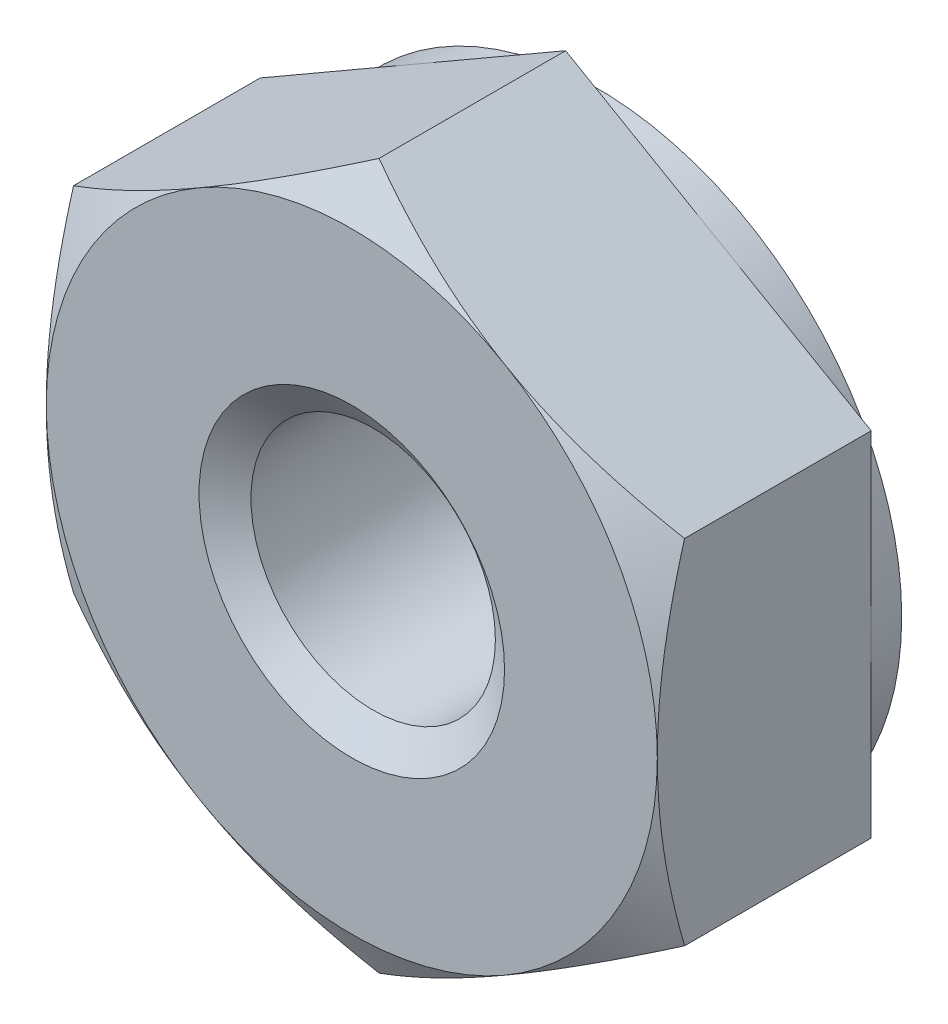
ISO-10303-21;
HEADER;
FILE_DESCRIPTION(('STEP AP214'),'2;1');
FILE_NAME('part.step','',(''),(''),'','','');
FILE_SCHEMA(('AUTOMOTIVE_DESIGN { 1 0 10303 214 1 1 1 1 }'));
ENDSEC;
DATA;
#1=APPLICATION_CONTEXT('core data for automotive mechanical design processes');
#2=APPLICATION_PROTOCOL_DEFINITION('international standard','automotive_design',2000,#1);
#3=PRODUCT_CONTEXT('',#1,'mechanical');
#4=PRODUCT('Part','Part','',(#3));
#5=PRODUCT_RELATED_PRODUCT_CATEGORY('part','',(#4));
#6=PRODUCT_DEFINITION_FORMATION('','',#4);
#7=PRODUCT_DEFINITION_CONTEXT('part definition',#1,'design');
#8=PRODUCT_DEFINITION('design','',#6,#7);
#9=PRODUCT_DEFINITION_SHAPE('','',#8);
#10=(LENGTH_UNIT() NAMED_UNIT(*) SI_UNIT(.MILLI.,.METRE.));
#11=(NAMED_UNIT(*) PLANE_ANGLE_UNIT() SI_UNIT($,.RADIAN.));
#12=(NAMED_UNIT(*) SI_UNIT($,.STERADIAN.) SOLID_ANGLE_UNIT());
#13=UNCERTAINTY_MEASURE_WITH_UNIT(LENGTH_MEASURE(1.E-05),#10,'distance_accuracy_value','');
#14=(GEOMETRIC_REPRESENTATION_CONTEXT(3) GLOBAL_UNCERTAINTY_ASSIGNED_CONTEXT((#13)) GLOBAL_UNIT_ASSIGNED_CONTEXT((#10,
#11,#12)) REPRESENTATION_CONTEXT('',''));
#15=CARTESIAN_POINT('',(0.,0.,0.));
#16=DIRECTION('',(0.,0.,1.));
#17=DIRECTION('',(1.,0.,0.));
#18=AXIS2_PLACEMENT_3D('',#15,#16,#17);
#19=CARTESIAN_POINT('',(0.,0.,-1.6));
#20=DIRECTION('',(0.,0.,1.));
#21=DIRECTION('',(1.,0.,0.));
#22=AXIS2_PLACEMENT_3D('',#19,#20,#21);
#23=CYLINDRICAL_SURFACE('',#22,0.8);
#24=CARTESIAN_POINT('',(0.,0.,-0.140041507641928));
#25=DIRECTION('',(0.,0.,1.));
#26=DIRECTION('',(1.,0.,0.));
#27=AXIS2_PLACEMENT_3D('',#24,#25,#26);
#28=CIRCLE('',#27,0.8);
#29=CARTESIAN_POINT('',(0.8,0.,-0.140041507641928));
#30=VERTEX_POINT('',#29);
#31=EDGE_CURVE('E148',#30,#30,#28,.F.);
#32=ORIENTED_EDGE('',*,*,#31,.F.);
#33=EDGE_LOOP('',(#32));
#34=FACE_BOUND('',#33,.T.);
#35=CARTESIAN_POINT('',(0.,0.,-1.43455849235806));
#36=DIRECTION('',(0.,0.,-1.));
#37=DIRECTION('',(-1.,0.,0.));
#38=AXIS2_PLACEMENT_3D('',#35,#36,#37);
#39=CIRCLE('',#38,0.8);
#40=CARTESIAN_POINT('',(-0.8,0.,-1.43455849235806));
#41=VERTEX_POINT('',#40);
#42=EDGE_CURVE('E36',#41,#41,#39,.F.);
#43=ORIENTED_EDGE('',*,*,#42,.F.);
#44=EDGE_LOOP('',(#43));
#45=FACE_BOUND('',#44,.T.);
#46=ADVANCED_FACE('F31',(#34,#45),#23,.F.);
#47=CARTESIAN_POINT('',(0.,2.30940107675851,-1.6));
#48=DIRECTION('',(0.,0.,-1.));
#49=DIRECTION('',(-1.,0.,0.));
#50=AXIS2_PLACEMENT_3D('',#47,#48,#49);
#51=PLANE('',#50);
#52=CARTESIAN_POINT('',(0.,0.,-1.6));
#53=DIRECTION('',(0.,0.,-1.));
#54=DIRECTION('',(-1.,0.,0.));
#55=AXIS2_PLACEMENT_3D('',#52,#53,#54);
#56=CIRCLE('',#55,2.);
#57=CARTESIAN_POINT('',(-2.,0.,-1.6));
#58=VERTEX_POINT('',#57);
#59=EDGE_CURVE('E275',#58,#58,#56,.F.);
#60=ORIENTED_EDGE('',*,*,#59,.F.);
#61=EDGE_LOOP('',(#60));
#62=FACE_BOUND('',#61,.T.);
#63=CARTESIAN_POINT('',(0.,0.,-1.6));
#64=DIRECTION('',(0.,0.,-1.));
#65=DIRECTION('',(-1.,0.,0.));
#66=AXIS2_PLACEMENT_3D('',#63,#64,#65);
#67=CIRCLE('',#66,1.);
#68=CARTESIAN_POINT('',(-1.,0.,-1.6));
#69=VERTEX_POINT('',#68);
#70=EDGE_CURVE('E295',#69,#69,#67,.F.);
#71=ORIENTED_EDGE('',*,*,#70,.T.);
#72=EDGE_LOOP('',(#71));
#73=FACE_BOUND('',#72,.T.);
#74=ADVANCED_FACE('F227',(#62,#73),#51,.T.);
#75=CARTESIAN_POINT('',(0.,2.30940107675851,0.));
#76=DIRECTION('',(0.,0.,-1.));
#77=DIRECTION('',(-1.,0.,0.));
#78=AXIS2_PLACEMENT_3D('',#75,#76,#77);
#79=PLANE('',#78);
#80=CARTESIAN_POINT('',(0.,0.,0.));
#81=DIRECTION('',(0.,0.,-1.));
#82=DIRECTION('',(-1.,0.,0.));
#83=AXIS2_PLACEMENT_3D('',#80,#81,#82);
#84=CIRCLE('',#83,2.);
#85=CARTESIAN_POINT('',(-1.00000000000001,1.73205080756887,0.));
#86=VERTEX_POINT('',#85);
#87=CARTESIAN_POINT('',(-2.,0.,0.));
#88=VERTEX_POINT('',#87);
#89=EDGE_CURVE('E43',#86,#88,#84,.F.);
#90=ORIENTED_EDGE('',*,*,#89,.T.);
#91=CARTESIAN_POINT('',(-1.00000000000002,-1.73205080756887,0.));
#92=VERTEX_POINT('',#91);
#93=EDGE_CURVE('E12',#88,#92,#84,.F.);
#94=ORIENTED_EDGE('',*,*,#93,.T.);
#95=CARTESIAN_POINT('',(1.00000000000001,-1.73205080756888,0.));
#96=VERTEX_POINT('',#95);
#97=EDGE_CURVE('E41',#92,#96,#84,.F.);
#98=ORIENTED_EDGE('',*,*,#97,.T.);
#99=CARTESIAN_POINT('',(2.,0.,0.));
#100=VERTEX_POINT('',#99);
#101=EDGE_CURVE('E127',#96,#100,#84,.F.);
#102=ORIENTED_EDGE('',*,*,#101,.T.);
#103=CARTESIAN_POINT('',(0.,0.,0.));
#104=DIRECTION('',(0.,0.,1.));
#105=DIRECTION('',(1.,0.,0.));
#106=AXIS2_PLACEMENT_3D('',#103,#104,#105);
#107=CIRCLE('',#106,2.);
#108=CARTESIAN_POINT('',(1.00000000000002,1.73205080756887,0.));
#109=VERTEX_POINT('',#108);
#110=EDGE_CURVE('E139',#100,#109,#107,.T.);
#111=ORIENTED_EDGE('',*,*,#110,.T.);
#112=EDGE_CURVE('E154',#109,#86,#84,.F.);
#113=ORIENTED_EDGE('',*,*,#112,.T.);
#114=EDGE_LOOP('',(#90,#94,#98,#102,#111,#113));
#115=FACE_BOUND('',#114,.T.);
#116=CARTESIAN_POINT('',(0.,0.,0.));
#117=DIRECTION('',(0.,0.,1.));
#118=DIRECTION('',(1.,0.,0.));
#119=AXIS2_PLACEMENT_3D('',#116,#117,#118);
#120=CIRCLE('',#119,1.);
#121=CARTESIAN_POINT('',(1.,0.,0.));
#122=VERTEX_POINT('',#121);
#123=EDGE_CURVE('E294',#122,#122,#120,.T.);
#124=ORIENTED_EDGE('',*,*,#123,.F.);
#125=EDGE_LOOP('',(#124));
#126=FACE_BOUND('',#125,.T.);
#127=ADVANCED_FACE('F151',(#115,#126),#79,.F.);
#128=CARTESIAN_POINT('',(0.,2.30940107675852,-1.6));
#129=DIRECTION('',(-0.500000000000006,0.866025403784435,0.));
#130=DIRECTION('',(-0.866025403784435,-0.500000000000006,0.));
#131=AXIS2_PLACEMENT_3D('',#128,#129,#130);
#132=PLANE('',#131);
#133=DIRECTION('',(0.,0.,1.));
#134=VECTOR('',#133,1.);
#135=CARTESIAN_POINT('',(-2.,1.15470053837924,-1.6));
#136=LINE('',#135,#134);
#137=CARTESIAN_POINT('',(-2.,1.15470053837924,-1.40000000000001));
#138=VERTEX_POINT('',#137);
#139=CARTESIAN_POINT('',(-2.,1.15470053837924,-0.178632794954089));
#140=VERTEX_POINT('',#139);
#141=EDGE_CURVE('E284',#138,#140,#136,.T.);
#142=ORIENTED_EDGE('',*,*,#141,.T.);
#143=CARTESIAN_POINT('',(-2.0002,1.1545850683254,-0.178699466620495));
#144=CARTESIAN_POINT('',(-1.91230873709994,1.20532911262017,-0.149389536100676));
#145=CARTESIAN_POINT('',(-1.82365880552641,1.25651117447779,-0.122732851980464));
#146=CARTESIAN_POINT('',(-1.6448237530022,1.35976164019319,-0.0762024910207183));
#147=CARTESIAN_POINT('',(-1.55463545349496,1.41183187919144,-0.0563452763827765));
#148=CARTESIAN_POINT('',(-1.3753766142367,1.51532701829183,-0.0254334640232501));
#149=CARTESIAN_POINT('',(-1.2863336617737,1.56673599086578,-0.0141731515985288));
#150=CARTESIAN_POINT('',(-1.10782860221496,1.66979593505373,-0.000728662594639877));
#151=CARTESIAN_POINT('',(-1.01836714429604,1.72144653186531,0.00146664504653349));
#152=CARTESIAN_POINT('',(-0.851191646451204,1.81796535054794,-0.00309098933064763));
#153=CARTESIAN_POINT('',(-0.773452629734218,1.86284799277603,-0.00872487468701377));
#154=CARTESIAN_POINT('',(-0.618481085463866,1.95232085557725,-0.0265838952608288));
#155=CARTESIAN_POINT('',(-0.5412490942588,1.99691076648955,-0.0388151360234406));
#156=CARTESIAN_POINT('',(-0.385957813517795,2.08656822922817,-0.0693934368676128));
#157=CARTESIAN_POINT('',(-0.307918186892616,2.13162442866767,-0.0878701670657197));
#158=CARTESIAN_POINT('',(-0.153003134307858,2.22106467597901,-0.129805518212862));
#159=CARTESIAN_POINT('',(-0.0761257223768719,2.26544987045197,-0.15325428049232));
#160=CARTESIAN_POINT('',(0.000200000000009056,2.30951654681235,-0.178699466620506));
#161=B_SPLINE_CURVE_WITH_KNOTS('',3,(#143,#144,#145,#146,#147,#148,#149,#150,#151,#152,#153,
#154,#155,#156,#157,#158,#159,#160),.UNSPECIFIED.,.F.,.F.,(4,2,2,2,2,2,2,2,4),(0.,
0.31703182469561,0.634825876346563,0.944753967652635,1.25430138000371,1.52387047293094,
1.79368946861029,2.06949491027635,2.34475850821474),.UNSPECIFIED.);
#162=EDGE_CURVE('E55',#140,#86,#161,.T.);
#163=ORIENTED_EDGE('',*,*,#162,.T.);
#164=CARTESIAN_POINT('',(0.,2.30940107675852,-0.178632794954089));
#165=VERTEX_POINT('',#164);
#166=EDGE_CURVE('E163',#86,#165,#161,.T.);
#167=ORIENTED_EDGE('',*,*,#166,.T.);
#168=DIRECTION('',(0.,0.,1.));
#169=VECTOR('',#168,1.);
#170=CARTESIAN_POINT('',(0.,2.30940107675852,-1.6));
#171=LINE('',#170,#169);
#172=CARTESIAN_POINT('',(0.,2.30940107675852,-1.40000000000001));
#173=VERTEX_POINT('',#172);
#174=EDGE_CURVE('E272',#173,#165,#171,.T.);
#175=ORIENTED_EDGE('',*,*,#174,.F.);
#176=DIRECTION('',(-0.866025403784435,-0.500000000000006,0.));
#177=VECTOR('',#176,1.);
#178=CARTESIAN_POINT('',(0.,2.30940107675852,-1.40000000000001));
#179=LINE('',#178,#177);
#180=CARTESIAN_POINT('',(-1.00000000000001,1.73205080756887,-1.40000000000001));
#181=VERTEX_POINT('',#180);
#182=EDGE_CURVE('E260',#173,#181,#179,.T.);
#183=ORIENTED_EDGE('',*,*,#182,.T.);
#184=EDGE_CURVE('E256',#181,#138,#179,.T.);
#185=ORIENTED_EDGE('',*,*,#184,.T.);
#186=EDGE_LOOP('',(#142,#163,#167,#175,#183,#185));
#187=FACE_BOUND('',#186,.T.);
#188=ADVANCED_FACE('F33',(#187),#132,.T.);
#189=CARTESIAN_POINT('',(2.00000000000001,1.15470053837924,-1.6));
#190=DIRECTION('',(0.500000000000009,0.866025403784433,0.));
#191=DIRECTION('',(-0.866025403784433,0.500000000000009,0.));
#192=AXIS2_PLACEMENT_3D('',#189,#190,#191);
#193=PLANE('',#192);
#194=ORIENTED_EDGE('',*,*,#174,.T.);
#195=CARTESIAN_POINT('',(-0.000199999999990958,2.30951654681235,-0.178699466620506));
#196=CARTESIAN_POINT('',(0.0876912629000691,2.25877250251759,-0.149389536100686));
#197=CARTESIAN_POINT('',(0.1763411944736,2.20759044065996,-0.122732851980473));
#198=CARTESIAN_POINT('',(0.355176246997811,2.10433997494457,-0.0762024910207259));
#199=CARTESIAN_POINT('',(0.445364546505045,2.05226973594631,-0.0563452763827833));
#200=CARTESIAN_POINT('',(0.624623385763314,1.94877459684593,-0.0254334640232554));
#201=CARTESIAN_POINT('',(0.713666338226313,1.89736562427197,-0.0141731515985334));
#202=CARTESIAN_POINT('',(0.892171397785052,1.79430568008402,-0.00072866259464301));
#203=CARTESIAN_POINT('',(0.981632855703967,1.74265508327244,0.00146664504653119));
#204=CARTESIAN_POINT('',(1.14880835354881,1.64613626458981,-0.00309098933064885));
#205=CARTESIAN_POINT('',(1.22654737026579,1.60125362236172,-0.00872487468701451));
#206=CARTESIAN_POINT('',(1.38151891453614,1.5117807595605,-0.026583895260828));
#207=CARTESIAN_POINT('',(1.45875090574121,1.4671908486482,-0.0388151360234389));
#208=CARTESIAN_POINT('',(1.61404218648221,1.37753338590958,-0.0693934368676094));
#209=CARTESIAN_POINT('',(1.69208181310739,1.33247718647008,-0.0878701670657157));
#210=CARTESIAN_POINT('',(1.84699686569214,1.24303693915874,-0.129805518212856));
#211=CARTESIAN_POINT('',(1.92387427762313,1.19865174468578,-0.153254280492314));
#212=CARTESIAN_POINT('',(2.00020000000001,1.1545850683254,-0.178699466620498));
#213=B_SPLINE_CURVE_WITH_KNOTS('',3,(#195,#196,#197,#198,#199,#200,#201,#202,#203,#204,#205,
#206,#207,#208,#209,#210,#211,#212),.UNSPECIFIED.,.F.,.F.,(4,2,2,2,2,2,2,2,4),(0.,
0.317031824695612,0.634825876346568,0.944753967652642,1.25430138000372,1.52387047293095,
1.79368946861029,2.06949491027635,2.34475850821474),.UNSPECIFIED.);
#214=EDGE_CURVE('E160',#165,#109,#213,.T.);
#215=ORIENTED_EDGE('',*,*,#214,.T.);
#216=CARTESIAN_POINT('',(2.00000000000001,1.15470053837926,-0.178632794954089));
#217=VERTEX_POINT('',#216);
#218=EDGE_CURVE('E142',#109,#217,#213,.T.);
#219=ORIENTED_EDGE('',*,*,#218,.T.);
#220=DIRECTION('',(0.,0.,1.));
#221=VECTOR('',#220,1.);
#222=CARTESIAN_POINT('',(2.00000000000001,1.15470053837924,-1.6));
#223=LINE('',#222,#221);
#224=CARTESIAN_POINT('',(2.00000000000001,1.15470053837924,-1.40000000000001));
#225=VERTEX_POINT('',#224);
#226=EDGE_CURVE('E159',#225,#217,#223,.T.);
#227=ORIENTED_EDGE('',*,*,#226,.F.);
#228=DIRECTION('',(-0.866025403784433,0.500000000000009,0.));
#229=VECTOR('',#228,1.);
#230=CARTESIAN_POINT('',(2.00000000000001,1.15470053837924,-1.40000000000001));
#231=LINE('',#230,#229);
#232=CARTESIAN_POINT('',(1.00000000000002,1.73205080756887,-1.40000000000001));
#233=VERTEX_POINT('',#232);
#234=EDGE_CURVE('E268',#225,#233,#231,.T.);
#235=ORIENTED_EDGE('',*,*,#234,.T.);
#236=EDGE_CURVE('E264',#233,#173,#231,.T.);
#237=ORIENTED_EDGE('',*,*,#236,.T.);
#238=EDGE_LOOP('',(#194,#215,#219,#227,#235,#237));
#239=FACE_BOUND('',#238,.T.);
#240=ADVANCED_FACE('F240',(#239),#193,.T.);
#241=CARTESIAN_POINT('',(2.00000000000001,1.15470053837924,-1.6));
#242=DIRECTION('',(-1.,0.,0.));
#243=DIRECTION('',(0.,0.,1.));
#244=AXIS2_PLACEMENT_3D('',#241,#242,#243);
#245=PLANE('',#244);
#246=CARTESIAN_POINT('',(2.00000000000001,-3.0624359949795,-0.957053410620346));
#247=CARTESIAN_POINT('',(2.00000000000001,-2.97462468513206,-0.914618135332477));
#248=CARTESIAN_POINT('',(2.00000000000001,-2.88660576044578,-0.872604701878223));
#249=CARTESIAN_POINT('',(2.00000000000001,-2.7100404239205,-0.789662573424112));
#250=CARTESIAN_POINT('',(2.00000000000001,-2.62149392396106,-0.748734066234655));
#251=CARTESIAN_POINT('',(2.00000000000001,-2.44328285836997,-0.667987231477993));
#252=CARTESIAN_POINT('',(2.00000000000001,-2.35361479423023,-0.628176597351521));
#253=CARTESIAN_POINT('',(2.00000000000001,-2.17354167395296,-0.55026529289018));
#254=CARTESIAN_POINT('',(2.00000000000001,-2.08313665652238,-0.51216453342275));
#255=CARTESIAN_POINT('',(2.00000000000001,-1.90031404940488,-0.437671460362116));
#256=CARTESIAN_POINT('',(2.00000000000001,-1.80788540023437,-0.401306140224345));
#257=CARTESIAN_POINT('',(2.00000000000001,-1.62195694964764,-0.33143120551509));
#258=CARTESIAN_POINT('',(2.00000000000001,-1.52845725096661,-0.297921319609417));
#259=CARTESIAN_POINT('',(2.00000000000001,-1.34040158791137,-0.234645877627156));
#260=CARTESIAN_POINT('',(2.00000000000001,-1.24584820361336,-0.204872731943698));
#261=CARTESIAN_POINT('',(2.00000000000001,-1.05539728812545,-0.150041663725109));
#262=CARTESIAN_POINT('',(2.00000000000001,-0.959500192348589,-0.124982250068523));
#263=CARTESIAN_POINT('',(2.00000000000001,-0.766296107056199,-0.0807954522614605));
#264=CARTESIAN_POINT('',(2.00000000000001,-0.668988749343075,-0.0616696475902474));
#265=CARTESIAN_POINT('',(2.00000000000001,-0.473201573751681,-0.0306369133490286));
#266=CARTESIAN_POINT('',(2.00000000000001,-0.374721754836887,-0.0187299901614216));
#267=CARTESIAN_POINT('',(2.00000000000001,-0.177725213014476,-0.00319166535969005));
#268=CARTESIAN_POINT('',(2.00000000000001,-0.0792127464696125,0.000492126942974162));
#269=CARTESIAN_POINT('',(2.00000000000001,0.117733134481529,-0.000599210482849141));
#270=CARTESIAN_POINT('',(2.00000000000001,0.216166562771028,-0.00537214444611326));
#271=CARTESIAN_POINT('',(2.00000000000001,0.454297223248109,-0.0267243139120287));
#272=CARTESIAN_POINT('',(2.00000000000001,0.593620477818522,-0.0474829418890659));
#273=CARTESIAN_POINT('',(2.00000000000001,0.869689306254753,-0.102199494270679));
#274=CARTESIAN_POINT('',(2.00000000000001,1.0064316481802,-0.136172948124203));
#275=CARTESIAN_POINT('',(2.00000000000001,1.21108706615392,-0.194758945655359));
#276=CARTESIAN_POINT('',(2.00000000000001,1.28004655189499,-0.215857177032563));
#277=CARTESIAN_POINT('',(2.00000000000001,1.41724192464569,-0.260142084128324));
#278=CARTESIAN_POINT('',(2.00000000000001,1.48547827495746,-0.283327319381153));
#279=CARTESIAN_POINT('',(2.00000000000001,1.62094688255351,-0.331302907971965));
#280=CARTESIAN_POINT('',(2.00000000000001,1.68818262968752,-0.356083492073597));
#281=CARTESIAN_POINT('',(2.00000000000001,1.82213246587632,-0.40709914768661));
#282=CARTESIAN_POINT('',(2.00000000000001,1.88884633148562,-0.433334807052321));
#283=CARTESIAN_POINT('',(2.00000000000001,1.95531849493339,-0.46015450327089));
#284=B_SPLINE_CURVE_WITH_KNOTS('',3,(#246,#247,#248,#249,#250,#251,#252,#253,#254,#255,#256,
#257,#258,#259,#260,#261,#262,#263,#264,#265,#266,#267,#268,#269,#270,#271,#272,#273,#274,#275,
#276,#277,#278,#279,#280,#281,#282,#283),.UNSPECIFIED.,.F.,.F.,(4,2,2,2,2,2,2,2,2,2,2,2,2,2,2,2,
2,2,4),(0.,0.292585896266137,0.585222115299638,0.879532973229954,1.17382847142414,
1.47176772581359,1.76967863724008,2.06697432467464,2.364175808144,2.66145633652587,
2.95873712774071,3.25411843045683,3.54942304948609,3.97114178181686,4.39335760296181,
4.60967655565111,4.82584733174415,5.04080135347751,5.255842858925),.UNSPECIFIED.);
#285=CARTESIAN_POINT('',(1.99999999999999,-1.15470053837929,-0.178632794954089));
#286=VERTEX_POINT('',#285);
#287=EDGE_CURVE('E123',#286,#100,#284,.T.);
#288=ORIENTED_EDGE('',*,*,#287,.F.);
#289=DIRECTION('',(0.,0.,1.));
#290=VECTOR('',#289,1.);
#291=CARTESIAN_POINT('',(2.00000000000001,-1.15470053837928,-1.6));
#292=LINE('',#291,#290);
#293=CARTESIAN_POINT('',(2.00000000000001,-1.15470053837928,-1.40000000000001));
#294=VERTEX_POINT('',#293);
#295=EDGE_CURVE('E277',#294,#286,#292,.T.);
#296=ORIENTED_EDGE('',*,*,#295,.F.);
#297=DIRECTION('',(0.,-1.,0.));
#298=VECTOR('',#297,1.);
#299=CARTESIAN_POINT('',(2.00000000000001,1.15470053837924,-1.40000000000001));
#300=LINE('',#299,#298);
#301=CARTESIAN_POINT('',(2.00000000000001,0.,-1.40000000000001));
#302=VERTEX_POINT('',#301);
#303=EDGE_CURVE('E269',#302,#294,#300,.T.);
#304=ORIENTED_EDGE('',*,*,#303,.F.);
#305=EDGE_CURVE('E271',#225,#302,#300,.T.);
#306=ORIENTED_EDGE('',*,*,#305,.F.);
#307=ORIENTED_EDGE('',*,*,#226,.T.);
#308=EDGE_CURVE('E136',#100,#217,#284,.T.);
#309=ORIENTED_EDGE('',*,*,#308,.F.);
#310=EDGE_LOOP('',(#288,#296,#304,#306,#307,#309));
#311=FACE_BOUND('',#310,.T.);
#312=ADVANCED_FACE('F156',(#311),#245,.F.);
#313=CARTESIAN_POINT('',(0.,-2.30940107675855,-1.6));
#314=DIRECTION('',(0.500000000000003,-0.866025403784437,0.));
#315=DIRECTION('',(0.866025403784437,0.500000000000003,0.));
#316=AXIS2_PLACEMENT_3D('',#313,#314,#315);
#317=PLANE('',#316);
#318=ORIENTED_EDGE('',*,*,#295,.T.);
#319=CARTESIAN_POINT('',(2.00020000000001,-1.15458506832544,-0.178699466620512));
#320=CARTESIAN_POINT('',(1.91230873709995,-1.20532911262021,-0.149389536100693));
#321=CARTESIAN_POINT('',(1.82365880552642,-1.25651117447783,-0.122732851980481));
#322=CARTESIAN_POINT('',(1.6448237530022,-1.35976164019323,-0.0762024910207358));
#323=CARTESIAN_POINT('',(1.55463545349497,-1.41183187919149,-0.0563452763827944));
#324=CARTESIAN_POINT('',(1.3753766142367,-1.51532701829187,-0.0254334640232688));
#325=CARTESIAN_POINT('',(1.2863336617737,-1.56673599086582,-0.0141731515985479));
#326=CARTESIAN_POINT('',(1.10782860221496,-1.66979593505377,-0.000728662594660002));
#327=CARTESIAN_POINT('',(1.01836714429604,-1.72144653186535,0.00146664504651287));
#328=CARTESIAN_POINT('',(0.8511916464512,-1.81796535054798,-0.00309098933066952));
#329=CARTESIAN_POINT('',(0.773452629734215,-1.86284799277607,-0.00872487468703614));
#330=CARTESIAN_POINT('',(0.618481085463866,-1.95232085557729,-0.0265838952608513));
#331=CARTESIAN_POINT('',(0.541249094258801,-1.99691076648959,-0.0388151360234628));
#332=CARTESIAN_POINT('',(0.385957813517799,-2.08656822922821,-0.0693934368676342));
#333=CARTESIAN_POINT('',(0.307918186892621,-2.13162442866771,-0.0878701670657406));
#334=CARTESIAN_POINT('',(0.153003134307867,-2.22106467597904,-0.129805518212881));
#335=CARTESIAN_POINT('',(0.076125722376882,-2.265449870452,-0.153254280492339));
#336=CARTESIAN_POINT('',(-0.000199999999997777,-2.30951654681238,-0.178699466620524));
#337=B_SPLINE_CURVE_WITH_KNOTS('',3,(#319,#320,#321,#322,#323,#324,#325,#326,#327,#328,#329,
#330,#331,#332,#333,#334,#335,#336),.UNSPECIFIED.,.F.,.F.,(4,2,2,2,2,2,2,2,4),(0.,
0.317031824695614,0.634825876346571,0.944753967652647,1.25430138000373,1.52387047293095,
1.7936894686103,2.06949491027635,2.34475850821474),.UNSPECIFIED.);
#338=EDGE_CURVE('E130',#286,#96,#337,.T.);
#339=ORIENTED_EDGE('',*,*,#338,.T.);
#340=CARTESIAN_POINT('',(0.,-2.30940107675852,-0.178632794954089));
#341=VERTEX_POINT('',#340);
#342=EDGE_CURVE('E170',#96,#341,#337,.T.);
#343=ORIENTED_EDGE('',*,*,#342,.T.);
#344=DIRECTION('',(0.,0.,1.));
#345=VECTOR('',#344,1.);
#346=CARTESIAN_POINT('',(0.,-2.30940107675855,-1.6));
#347=LINE('',#346,#345);
#348=CARTESIAN_POINT('',(0.,-2.30940107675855,-1.40000000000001));
#349=VERTEX_POINT('',#348);
#350=EDGE_CURVE('E279',#349,#341,#347,.T.);
#351=ORIENTED_EDGE('',*,*,#350,.F.);
#352=DIRECTION('',(0.866025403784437,0.500000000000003,0.));
#353=VECTOR('',#352,1.);
#354=CARTESIAN_POINT('',(0.,-2.30940107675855,-1.40000000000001));
#355=LINE('',#354,#353);
#356=CARTESIAN_POINT('',(1.00000000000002,-1.7320508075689,-1.40000000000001));
#357=VERTEX_POINT('',#356);
#358=EDGE_CURVE('E261',#349,#357,#355,.T.);
#359=ORIENTED_EDGE('',*,*,#358,.T.);
#360=EDGE_CURVE('E265',#357,#294,#355,.T.);
#361=ORIENTED_EDGE('',*,*,#360,.T.);
#362=EDGE_LOOP('',(#318,#339,#343,#351,#359,#361));
#363=FACE_BOUND('',#362,.T.);
#364=ADVANCED_FACE('F213',(#363),#317,.T.);
#365=CARTESIAN_POINT('',(-2.,-1.15470053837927,-1.6));
#366=DIRECTION('',(-0.500000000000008,-0.866025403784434,0.));
#367=DIRECTION('',(0.866025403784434,-0.500000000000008,0.));
#368=AXIS2_PLACEMENT_3D('',#365,#366,#367);
#369=PLANE('',#368);
#370=ORIENTED_EDGE('',*,*,#350,.T.);
#371=CARTESIAN_POINT('',(0.000200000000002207,-2.30951654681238,-0.178699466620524));
#372=CARTESIAN_POINT('',(-0.0876912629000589,-2.25877250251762,-0.149389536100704));
#373=CARTESIAN_POINT('',(-0.176341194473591,-2.20759044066,-0.12273285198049));
#374=CARTESIAN_POINT('',(-0.355176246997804,-2.1043399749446,-0.0762024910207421));
#375=CARTESIAN_POINT('',(-0.44536454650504,-2.05226973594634,-0.0563452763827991));
#376=CARTESIAN_POINT('',(-0.624623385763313,-1.94877459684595,-0.0254334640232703));
#377=CARTESIAN_POINT('',(-0.713666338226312,-1.897365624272,-0.0141731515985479));
#378=CARTESIAN_POINT('',(-0.892171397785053,-1.79430568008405,-0.000728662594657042));
#379=CARTESIAN_POINT('',(-0.98163285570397,-1.74265508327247,0.00146664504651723));
#380=CARTESIAN_POINT('',(-1.14880835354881,-1.64613626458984,-0.00309098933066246));
#381=CARTESIAN_POINT('',(-1.22654737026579,-1.60125362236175,-0.00872487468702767));
#382=CARTESIAN_POINT('',(-1.38151891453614,-1.51178075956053,-0.0265838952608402));
#383=CARTESIAN_POINT('',(-1.45875090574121,-1.46719084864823,-0.0388151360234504));
#384=CARTESIAN_POINT('',(-1.61404218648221,-1.37753338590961,-0.0693934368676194));
#385=CARTESIAN_POINT('',(-1.69208181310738,-1.33247718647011,-0.0878701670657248));
#386=CARTESIAN_POINT('',(-1.84699686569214,-1.24303693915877,-0.129805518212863));
#387=CARTESIAN_POINT('',(-1.92387427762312,-1.19865174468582,-0.15325428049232));
#388=CARTESIAN_POINT('',(-2.0002,-1.15458506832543,-0.178699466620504));
#389=B_SPLINE_CURVE_WITH_KNOTS('',3,(#371,#372,#373,#374,#375,#376,#377,#378,#379,#380,#381,
#382,#383,#384,#385,#386,#387,#388),.UNSPECIFIED.,.F.,.F.,(4,2,2,2,2,2,2,2,4),(0.,
0.317031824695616,0.634825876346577,0.944753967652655,1.25430138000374,1.52387047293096,
1.7936894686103,2.06949491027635,2.34475850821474),.UNSPECIFIED.);
#390=EDGE_CURVE('E207',#341,#92,#389,.T.);
#391=ORIENTED_EDGE('',*,*,#390,.T.);
#392=CARTESIAN_POINT('',(-2.,-1.15470053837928,-0.178632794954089));
#393=VERTEX_POINT('',#392);
#394=EDGE_CURVE('E200',#92,#393,#389,.T.);
#395=ORIENTED_EDGE('',*,*,#394,.T.);
#396=DIRECTION('',(0.,0.,1.));
#397=VECTOR('',#396,1.);
#398=CARTESIAN_POINT('',(-2.,-1.15470053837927,-1.6));
#399=LINE('',#398,#397);
#400=CARTESIAN_POINT('',(-2.,-1.15470053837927,-1.40000000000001));
#401=VERTEX_POINT('',#400);
#402=EDGE_CURVE('E282',#401,#393,#399,.T.);
#403=ORIENTED_EDGE('',*,*,#402,.F.);
#404=DIRECTION('',(0.866025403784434,-0.500000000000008,0.));
#405=VECTOR('',#404,1.);
#406=CARTESIAN_POINT('',(-2.,-1.15470053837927,-1.40000000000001));
#407=LINE('',#406,#405);
#408=CARTESIAN_POINT('',(-1.00000000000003,-1.73205080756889,-1.40000000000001));
#409=VERTEX_POINT('',#408);
#410=EDGE_CURVE('E251',#401,#409,#407,.T.);
#411=ORIENTED_EDGE('',*,*,#410,.T.);
#412=EDGE_CURVE('E257',#409,#349,#407,.T.);
#413=ORIENTED_EDGE('',*,*,#412,.T.);
#414=EDGE_LOOP('',(#370,#391,#395,#403,#411,#413));
#415=FACE_BOUND('',#414,.T.);
#416=ADVANCED_FACE('F209',(#415),#369,.T.);
#417=CARTESIAN_POINT('',(-2.,1.15470053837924,-1.6));
#418=DIRECTION('',(-1.,0.,0.));
#419=DIRECTION('',(0.,0.,1.));
#420=AXIS2_PLACEMENT_3D('',#417,#418,#419);
#421=PLANE('',#420);
#422=ORIENTED_EDGE('',*,*,#402,.T.);
#423=CARTESIAN_POINT('',(-2.,-3.06243599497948,-0.957053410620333));
#424=CARTESIAN_POINT('',(-2.,-2.97462468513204,-0.914618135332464));
#425=CARTESIAN_POINT('',(-2.,-2.88660576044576,-0.87260470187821));
#426=CARTESIAN_POINT('',(-2.,-2.71004042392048,-0.789662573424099));
#427=CARTESIAN_POINT('',(-2.,-2.62149392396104,-0.748734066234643));
#428=CARTESIAN_POINT('',(-2.,-2.44328285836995,-0.667987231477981));
#429=CARTESIAN_POINT('',(-2.,-2.35361479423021,-0.628176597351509));
#430=CARTESIAN_POINT('',(-2.,-2.17354167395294,-0.550265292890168));
#431=CARTESIAN_POINT('',(-2.,-2.08313665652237,-0.512164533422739));
#432=CARTESIAN_POINT('',(-2.,-1.90031404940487,-0.437671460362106));
#433=CARTESIAN_POINT('',(-2.,-1.80788540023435,-0.401306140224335));
#434=CARTESIAN_POINT('',(-2.,-1.62195694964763,-0.331431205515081));
#435=CARTESIAN_POINT('',(-2.,-1.52845725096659,-0.297921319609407));
#436=CARTESIAN_POINT('',(-2.,-1.34040158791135,-0.234645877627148));
#437=CARTESIAN_POINT('',(-2.,-1.24584820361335,-0.20487273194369));
#438=CARTESIAN_POINT('',(-2.,-1.05539728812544,-0.150041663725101));
#439=CARTESIAN_POINT('',(-2.,-0.95950019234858,-0.124982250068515));
#440=CARTESIAN_POINT('',(-2.,-0.766296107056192,-0.0807954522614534));
#441=CARTESIAN_POINT('',(-2.,-0.668988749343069,-0.0616696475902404));
#442=CARTESIAN_POINT('',(-2.,-0.473201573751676,-0.030636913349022));
#443=CARTESIAN_POINT('',(-2.,-0.374721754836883,-0.0187299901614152));
#444=CARTESIAN_POINT('',(-2.,-0.177725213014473,-0.00319166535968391));
#445=CARTESIAN_POINT('',(-2.,-0.0792127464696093,0.000492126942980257));
#446=CARTESIAN_POINT('',(-2.,0.117733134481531,-0.000599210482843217));
#447=CARTESIAN_POINT('',(-2.,0.21616656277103,-0.00537214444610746));
#448=CARTESIAN_POINT('',(-2.,0.45429722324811,-0.026724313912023));
#449=CARTESIAN_POINT('',(-2.,0.593620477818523,-0.0474829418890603));
#450=CARTESIAN_POINT('',(-2.,0.869689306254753,-0.102199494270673));
#451=CARTESIAN_POINT('',(-2.,1.0064316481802,-0.136172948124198));
#452=CARTESIAN_POINT('',(-2.,1.21108706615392,-0.194758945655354));
#453=CARTESIAN_POINT('',(-2.,1.28004655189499,-0.215857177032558));
#454=CARTESIAN_POINT('',(-2.,1.41724192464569,-0.260142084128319));
#455=CARTESIAN_POINT('',(-2.,1.48547827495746,-0.283327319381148));
#456=CARTESIAN_POINT('',(-2.,1.62094688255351,-0.331302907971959));
#457=CARTESIAN_POINT('',(-2.,1.68818262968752,-0.356083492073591));
#458=CARTESIAN_POINT('',(-2.,1.82213246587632,-0.407099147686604));
#459=CARTESIAN_POINT('',(-2.,1.88884633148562,-0.433334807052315));
#460=CARTESIAN_POINT('',(-2.,1.95531849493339,-0.460154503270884));
#461=B_SPLINE_CURVE_WITH_KNOTS('',3,(#423,#424,#425,#426,#427,#428,#429,#430,#431,#432,#433,
#434,#435,#436,#437,#438,#439,#440,#441,#442,#443,#444,#445,#446,#447,#448,#449,#450,#451,#452,
#453,#454,#455,#456,#457,#458,#459,#460),.UNSPECIFIED.,.F.,.F.,(4,2,2,2,2,2,2,2,2,2,2,2,2,2,2,2,
2,2,4),(0.,0.292585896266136,0.585222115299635,0.87953297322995,1.17382847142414,
1.47176772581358,1.76967863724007,2.06697432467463,2.36417580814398,2.66145633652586,
2.95873712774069,3.25411843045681,3.54942304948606,3.97114178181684,4.39335760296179,
4.60967655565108,4.82584733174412,5.04080135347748,5.25584285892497),.UNSPECIFIED.);
#462=EDGE_CURVE('E208',#393,#88,#461,.T.);
#463=ORIENTED_EDGE('',*,*,#462,.T.);
#464=EDGE_CURVE('E147',#88,#140,#461,.T.);
#465=ORIENTED_EDGE('',*,*,#464,.T.);
#466=ORIENTED_EDGE('',*,*,#141,.F.);
#467=DIRECTION('',(0.,-1.,0.));
#468=VECTOR('',#467,1.);
#469=CARTESIAN_POINT('',(-2.,1.15470053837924,-1.40000000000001));
#470=LINE('',#469,#468);
#471=CARTESIAN_POINT('',(-2.,0.,-1.40000000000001));
#472=VERTEX_POINT('',#471);
#473=EDGE_CURVE('E291',#138,#472,#470,.T.);
#474=ORIENTED_EDGE('',*,*,#473,.T.);
#475=EDGE_CURVE('E289',#472,#401,#470,.T.);
#476=ORIENTED_EDGE('',*,*,#475,.T.);
#477=EDGE_LOOP('',(#422,#463,#465,#466,#474,#476));
#478=FACE_BOUND('',#477,.T.);
#479=ADVANCED_FACE('F212',(#478),#421,.T.);
#480=CARTESIAN_POINT('',(0.,12.3094010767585,-1.40000000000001));
#481=DIRECTION('',(0.,0.,-1.));
#482=DIRECTION('',(-1.,0.,0.));
#483=AXIS2_PLACEMENT_3D('',#480,#481,#482);
#484=PLANE('',#483);
#485=ORIENTED_EDGE('',*,*,#305,.T.);
#486=CARTESIAN_POINT('',(0.,0.,-1.40000000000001));
#487=DIRECTION('',(0.,0.,1.));
#488=DIRECTION('',(1.,0.,0.));
#489=AXIS2_PLACEMENT_3D('',#486,#487,#488);
#490=CIRCLE('',#489,2.);
#491=EDGE_CURVE('E248',#302,#233,#490,.T.);
#492=ORIENTED_EDGE('',*,*,#491,.T.);
#493=ORIENTED_EDGE('',*,*,#234,.F.);
#494=EDGE_LOOP('',(#485,#492,#493));
#495=FACE_BOUND('',#494,.T.);
#496=ADVANCED_FACE('F218',(#495),#484,.T.);
#497=ORIENTED_EDGE('',*,*,#303,.T.);
#498=ORIENTED_EDGE('',*,*,#360,.F.);
#499=EDGE_CURVE('E253',#357,#302,#490,.T.);
#500=ORIENTED_EDGE('',*,*,#499,.T.);
#501=EDGE_LOOP('',(#497,#498,#500));
#502=FACE_BOUND('',#501,.T.);
#503=ADVANCED_FACE('F223',(#502),#484,.T.);
#504=EDGE_CURVE('E252',#233,#181,#490,.T.);
#505=ORIENTED_EDGE('',*,*,#504,.T.);
#506=ORIENTED_EDGE('',*,*,#182,.F.);
#507=ORIENTED_EDGE('',*,*,#236,.F.);
#508=EDGE_LOOP('',(#505,#506,#507));
#509=FACE_BOUND('',#508,.T.);
#510=ADVANCED_FACE('F430',(#509),#484,.T.);
#511=ORIENTED_EDGE('',*,*,#412,.F.);
#512=EDGE_CURVE('E502',#409,#357,#490,.T.);
#513=ORIENTED_EDGE('',*,*,#512,.T.);
#514=ORIENTED_EDGE('',*,*,#358,.F.);
#515=EDGE_LOOP('',(#511,#513,#514));
#516=FACE_BOUND('',#515,.T.);
#517=ADVANCED_FACE('F421',(#516),#484,.T.);
#518=EDGE_CURVE('E519',#181,#472,#490,.T.);
#519=ORIENTED_EDGE('',*,*,#518,.T.);
#520=ORIENTED_EDGE('',*,*,#473,.F.);
#521=ORIENTED_EDGE('',*,*,#184,.F.);
#522=EDGE_LOOP('',(#519,#520,#521));
#523=FACE_BOUND('',#522,.T.);
#524=ADVANCED_FACE('F405',(#523),#484,.T.);
#525=CARTESIAN_POINT('',(0.,0.,0.));
#526=DIRECTION('',(0.,0.,1.));
#527=DIRECTION('',(1.,0.,0.));
#528=AXIS2_PLACEMENT_3D('',#525,#526,#527);
#529=CYLINDRICAL_SURFACE('',#528,2.);
#530=ORIENTED_EDGE('',*,*,#59,.T.);
#531=EDGE_LOOP('',(#530));
#532=FACE_BOUND('',#531,.T.);
#533=ORIENTED_EDGE('',*,*,#504,.F.);
#534=ORIENTED_EDGE('',*,*,#491,.F.);
#535=ORIENTED_EDGE('',*,*,#499,.F.);
#536=ORIENTED_EDGE('',*,*,#512,.F.);
#537=EDGE_CURVE('E514',#472,#409,#490,.T.);
#538=ORIENTED_EDGE('',*,*,#537,.F.);
#539=ORIENTED_EDGE('',*,*,#518,.F.);
#540=EDGE_LOOP('',(#533,#534,#535,#536,#538,#539));
#541=FACE_BOUND('',#540,.T.);
#542=ADVANCED_FACE('F237',(#532,#541),#529,.T.);
#543=ORIENTED_EDGE('',*,*,#475,.F.);
#544=ORIENTED_EDGE('',*,*,#537,.T.);
#545=ORIENTED_EDGE('',*,*,#410,.F.);
#546=EDGE_LOOP('',(#543,#544,#545));
#547=FACE_BOUND('',#546,.T.);
#548=ADVANCED_FACE('F190',(#547),#484,.T.);
#549=CARTESIAN_POINT('',(0.,0.,0.));
#550=DIRECTION('',(0.,0.,-1.));
#551=DIRECTION('',(-1.,0.,0.));
#552=AXIS2_PLACEMENT_3D('',#549,#550,#551);
#553=CONICAL_SURFACE('',#552,2.,1.04719755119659);
#554=ORIENTED_EDGE('',*,*,#464,.F.);
#555=ORIENTED_EDGE('',*,*,#89,.F.);
#556=ORIENTED_EDGE('',*,*,#162,.F.);
#557=EDGE_LOOP('',(#554,#555,#556));
#558=FACE_BOUND('',#557,.T.);
#559=ADVANCED_FACE('F367',(#558),#553,.T.);
#560=ORIENTED_EDGE('',*,*,#112,.F.);
#561=ORIENTED_EDGE('',*,*,#214,.F.);
#562=ORIENTED_EDGE('',*,*,#166,.F.);
#563=EDGE_LOOP('',(#560,#561,#562));
#564=FACE_BOUND('',#563,.T.);
#565=ADVANCED_FACE('F188',(#564),#553,.T.);
#566=ORIENTED_EDGE('',*,*,#110,.F.);
#567=ORIENTED_EDGE('',*,*,#308,.T.);
#568=ORIENTED_EDGE('',*,*,#218,.F.);
#569=EDGE_LOOP('',(#566,#567,#568));
#570=FACE_BOUND('',#569,.T.);
#571=ADVANCED_FACE('F140',(#570),#553,.T.);
#572=ORIENTED_EDGE('',*,*,#287,.T.);
#573=ORIENTED_EDGE('',*,*,#101,.F.);
#574=ORIENTED_EDGE('',*,*,#338,.F.);
#575=EDGE_LOOP('',(#572,#573,#574));
#576=FACE_BOUND('',#575,.T.);
#577=ADVANCED_FACE('F125',(#576),#553,.T.);
#578=ORIENTED_EDGE('',*,*,#97,.F.);
#579=ORIENTED_EDGE('',*,*,#390,.F.);
#580=ORIENTED_EDGE('',*,*,#342,.F.);
#581=EDGE_LOOP('',(#578,#579,#580));
#582=FACE_BOUND('',#581,.T.);
#583=ADVANCED_FACE('F187',(#582),#553,.T.);
#584=ORIENTED_EDGE('',*,*,#93,.F.);
#585=ORIENTED_EDGE('',*,*,#462,.F.);
#586=ORIENTED_EDGE('',*,*,#394,.F.);
#587=EDGE_LOOP('',(#584,#585,#586));
#588=FACE_BOUND('',#587,.T.);
#589=ADVANCED_FACE('F181',(#588),#553,.T.);
#590=CARTESIAN_POINT('',(0.,0.,-0.15404565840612));
#591=DIRECTION('',(0.,0.,1.));
#592=DIRECTION('',(1.,0.,0.));
#593=AXIS2_PLACEMENT_3D('',#590,#591,#592);
#594=CONICAL_SURFACE('',#593,0.780000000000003,0.959931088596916);
#595=ORIENTED_EDGE('',*,*,#123,.T.);
#596=EDGE_LOOP('',(#595));
#597=FACE_BOUND('',#596,.T.);
#598=ORIENTED_EDGE('',*,*,#31,.T.);
#599=EDGE_LOOP('',(#598));
#600=FACE_BOUND('',#599,.T.);
#601=ADVANCED_FACE('F186',(#597,#600),#594,.F.);
#602=CARTESIAN_POINT('',(0.,0.,-1.5746));
#603=DIRECTION('',(0.,0.,-1.));
#604=DIRECTION('',(-1.,0.,0.));
#605=AXIS2_PLACEMENT_3D('',#602,#603,#604);
#606=CONICAL_SURFACE('',#605,1.,0.95993108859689);
#607=CARTESIAN_POINT('',(0.,0.,-1.5746));
#608=DIRECTION('',(0.,0.,1.));
#609=DIRECTION('',(1.,0.,0.));
#610=AXIS2_PLACEMENT_3D('',#607,#608,#609);
#611=CIRCLE('',#610,1.);
#612=CARTESIAN_POINT('',(1.,0.,-1.5746));
#613=VERTEX_POINT('',#612);
#614=EDGE_CURVE('E297',#613,#613,#611,.T.);
#615=ORIENTED_EDGE('',*,*,#614,.F.);
#616=EDGE_LOOP('',(#615));
#617=FACE_BOUND('',#616,.T.);
#618=ORIENTED_EDGE('',*,*,#42,.T.);
#619=EDGE_LOOP('',(#618));
#620=FACE_BOUND('',#619,.T.);
#621=ADVANCED_FACE('F311',(#617,#620),#606,.F.);
#622=CARTESIAN_POINT('',(0.,0.,-25.0375057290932));
#623=DIRECTION('',(0.,0.,1.));
#624=DIRECTION('',(1.,0.,0.));
#625=AXIS2_PLACEMENT_3D('',#622,#623,#624);
#626=CYLINDRICAL_SURFACE('',#625,1.);
#627=ORIENTED_EDGE('',*,*,#70,.F.);
#628=EDGE_LOOP('',(#627));
#629=FACE_BOUND('',#628,.T.);
#630=ORIENTED_EDGE('',*,*,#614,.T.);
#631=EDGE_LOOP('',(#630));
#632=FACE_BOUND('',#631,.T.);
#633=ADVANCED_FACE('F315',(#629,#632),#626,.F.);
#634=CLOSED_SHELL('',(#46,#74,#127,#188,#240,#312,#364,#416,#479,#496,#503,#510,#517,#524,#542,
#548,#559,#565,#571,#577,#583,#589,#601,#621,#633));
#635=MANIFOLD_SOLID_BREP('B2',#634);
#636=ADVANCED_BREP_SHAPE_REPRESENTATION('',(#18,#635),#14);
#637=SHAPE_DEFINITION_REPRESENTATION(#9,#636);
ENDSEC;
END-ISO-10303-21;
